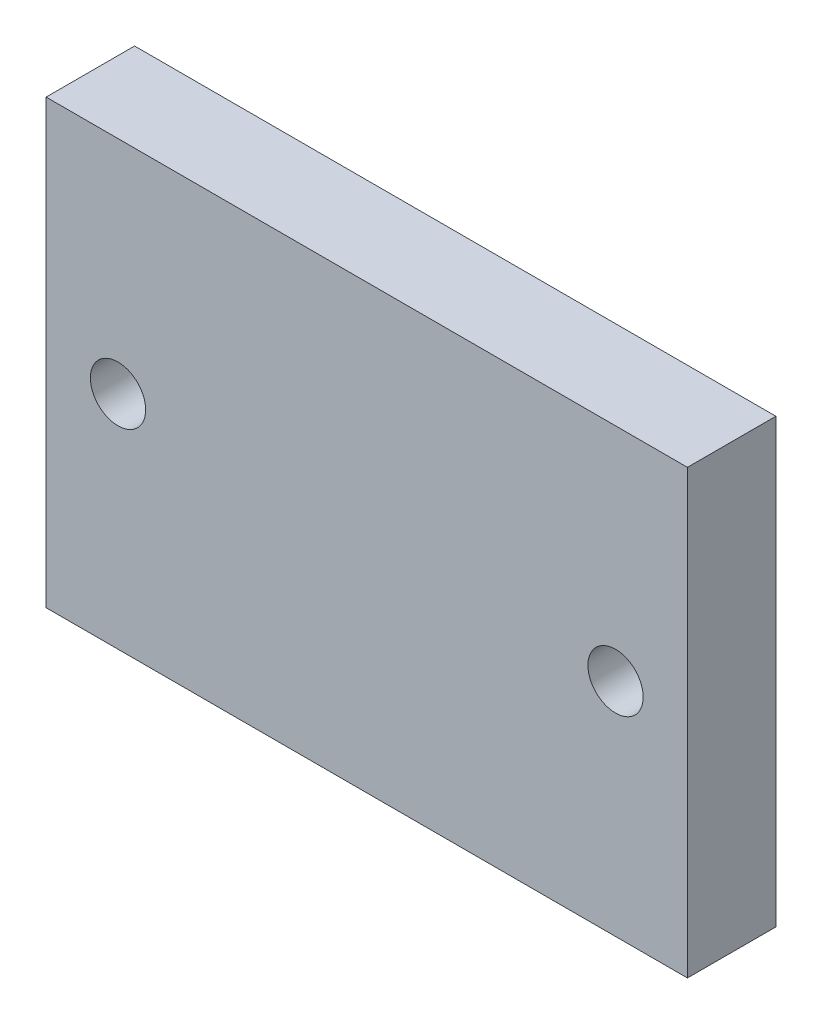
from build123d import *

# Parameters (mm, degrees)
ESQUISSE1_W           = 58
ESQUISSE1_H           = 40
EXTRUSION1_DEPTH      = 8
TROU_TARAUD_M61_D     = 5
TROU_TARAUD_M61_DEPTH = 17
TROU_TARAUD_M61_TIP   = 1.502151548


with BuildPart() as part:
    # Esquisse1 → Extrusion1 (new body)
    with BuildSketch(Plane.XY):
        Rectangle(ESQUISSE1_W, ESQUISSE1_H)
    extrude(amount=EXTRUSION1_DEPTH)

    # Trou taraud_ M61
    with Locations(Plane(origin=(0, 0, 0), x_dir=(-1, 0, 0), z_dir=(0, 0, -1))):
        with Locations((-22.5, 0), (22.5, 0)):
            Hole(TROU_TARAUD_M61_D / 2, depth=TROU_TARAUD_M61_DEPTH)
            with Locations((0, 0, -(TROU_TARAUD_M61_DEPTH + TROU_TARAUD_M61_TIP / 2))):  # 118° drill point
                Cone(0, TROU_TARAUD_M61_D / 2, TROU_TARAUD_M61_TIP, mode=Mode.SUBTRACT)


solid = part.part
